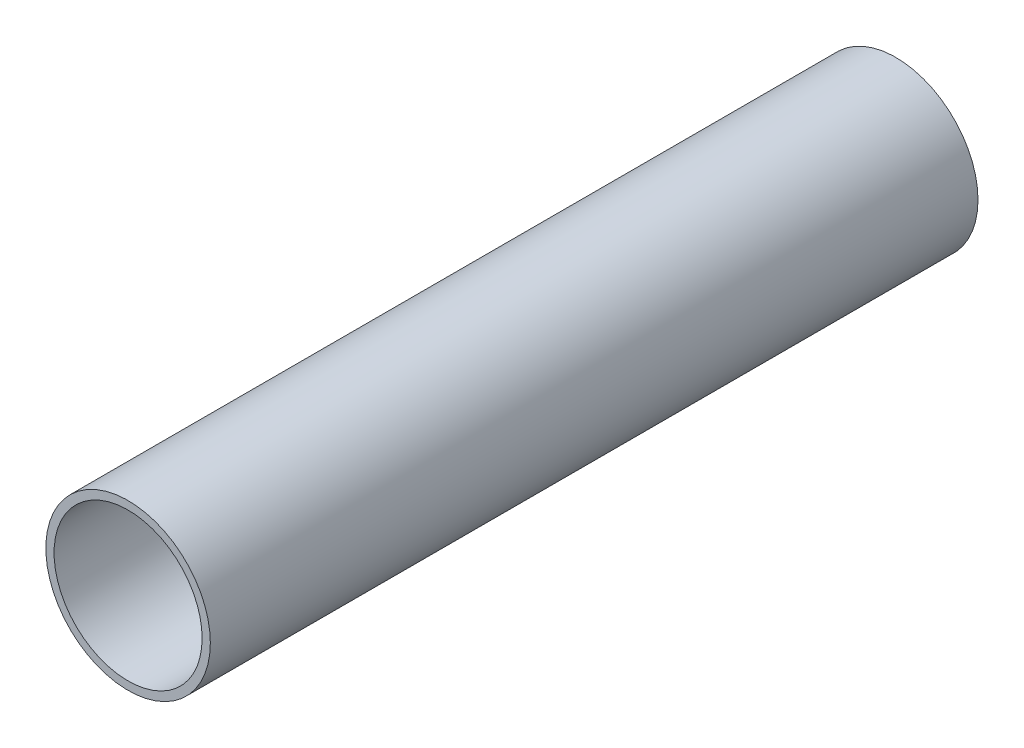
ISO-10303-21;
HEADER;
FILE_DESCRIPTION(('STEP AP214'),'2;1');
FILE_NAME('part.step','',(''),(''),'','','');
FILE_SCHEMA(('AUTOMOTIVE_DESIGN { 1 0 10303 214 1 1 1 1 }'));
ENDSEC;
DATA;
#1=APPLICATION_CONTEXT('core data for automotive mechanical design processes');
#2=APPLICATION_PROTOCOL_DEFINITION('international standard','automotive_design',2000,#1);
#3=PRODUCT_CONTEXT('',#1,'mechanical');
#4=PRODUCT('Part','Part','',(#3));
#5=PRODUCT_RELATED_PRODUCT_CATEGORY('part','',(#4));
#6=PRODUCT_DEFINITION_FORMATION('','',#4);
#7=PRODUCT_DEFINITION_CONTEXT('part definition',#1,'design');
#8=PRODUCT_DEFINITION('design','',#6,#7);
#9=PRODUCT_DEFINITION_SHAPE('','',#8);
#10=(LENGTH_UNIT() NAMED_UNIT(*) SI_UNIT(.MILLI.,.METRE.));
#11=(NAMED_UNIT(*) PLANE_ANGLE_UNIT() SI_UNIT($,.RADIAN.));
#12=(NAMED_UNIT(*) SI_UNIT($,.STERADIAN.) SOLID_ANGLE_UNIT());
#13=UNCERTAINTY_MEASURE_WITH_UNIT(LENGTH_MEASURE(1.E-05),#10,'distance_accuracy_value','');
#14=(GEOMETRIC_REPRESENTATION_CONTEXT(3) GLOBAL_UNCERTAINTY_ASSIGNED_CONTEXT((#13)) GLOBAL_UNIT_ASSIGNED_CONTEXT((#10,
#11,#12)) REPRESENTATION_CONTEXT('',''));
#15=CARTESIAN_POINT('',(0.,0.,0.));
#16=DIRECTION('',(0.,0.,1.));
#17=DIRECTION('',(1.,0.,0.));
#18=AXIS2_PLACEMENT_3D('',#15,#16,#17);
#19=CARTESIAN_POINT('',(0.,0.,140.));
#20=DIRECTION('',(0.,0.,1.));
#21=DIRECTION('',(1.,0.,0.));
#22=AXIS2_PLACEMENT_3D('',#19,#20,#21);
#23=PLANE('',#22);
#24=CARTESIAN_POINT('',(0.,0.,140.));
#25=DIRECTION('',(0.,0.,1.));
#26=DIRECTION('',(1.,0.,0.));
#27=AXIS2_PLACEMENT_3D('',#24,#25,#26);
#28=CIRCLE('',#27,15.);
#29=CARTESIAN_POINT('',(15.,0.,140.));
#30=VERTEX_POINT('',#29);
#31=EDGE_CURVE('E10',#30,#30,#28,.T.);
#32=ORIENTED_EDGE('',*,*,#31,.T.);
#33=EDGE_LOOP('',(#32));
#34=FACE_BOUND('',#33,.T.);
#35=CARTESIAN_POINT('',(0.,0.,140.));
#36=DIRECTION('',(0.,0.,1.));
#37=DIRECTION('',(1.,0.,0.));
#38=AXIS2_PLACEMENT_3D('',#35,#36,#37);
#39=CIRCLE('',#38,13.5);
#40=CARTESIAN_POINT('',(13.5,0.,140.));
#41=VERTEX_POINT('',#40);
#42=EDGE_CURVE('E39',#41,#41,#39,.T.);
#43=ORIENTED_EDGE('',*,*,#42,.F.);
#44=EDGE_LOOP('',(#43));
#45=FACE_BOUND('',#44,.T.);
#46=ADVANCED_FACE('F28',(#34,#45),#23,.T.);
#47=CARTESIAN_POINT('',(0.,0.,0.));
#48=DIRECTION('',(0.,0.,1.));
#49=DIRECTION('',(1.,0.,0.));
#50=AXIS2_PLACEMENT_3D('',#47,#48,#49);
#51=PLANE('',#50);
#52=CARTESIAN_POINT('',(0.,0.,0.));
#53=DIRECTION('',(0.,0.,1.));
#54=DIRECTION('',(1.,0.,0.));
#55=AXIS2_PLACEMENT_3D('',#52,#53,#54);
#56=CIRCLE('',#55,15.);
#57=CARTESIAN_POINT('',(15.,0.,0.));
#58=VERTEX_POINT('',#57);
#59=EDGE_CURVE('E32',#58,#58,#56,.T.);
#60=ORIENTED_EDGE('',*,*,#59,.F.);
#61=EDGE_LOOP('',(#60));
#62=FACE_BOUND('',#61,.T.);
#63=CARTESIAN_POINT('',(0.,0.,0.));
#64=DIRECTION('',(0.,0.,1.));
#65=DIRECTION('',(1.,0.,0.));
#66=AXIS2_PLACEMENT_3D('',#63,#64,#65);
#67=CIRCLE('',#66,13.5);
#68=CARTESIAN_POINT('',(13.5,0.,0.));
#69=VERTEX_POINT('',#68);
#70=EDGE_CURVE('E41',#69,#69,#67,.T.);
#71=ORIENTED_EDGE('',*,*,#70,.T.);
#72=EDGE_LOOP('',(#71));
#73=FACE_BOUND('',#72,.T.);
#74=ADVANCED_FACE('F51',(#62,#73),#51,.F.);
#75=CARTESIAN_POINT('',(0.,0.,140.));
#76=DIRECTION('',(0.,0.,-1.));
#77=DIRECTION('',(-1.,0.,0.));
#78=AXIS2_PLACEMENT_3D('',#75,#76,#77);
#79=CYLINDRICAL_SURFACE('',#78,15.);
#80=ORIENTED_EDGE('',*,*,#31,.F.);
#81=EDGE_LOOP('',(#80));
#82=FACE_BOUND('',#81,.T.);
#83=ORIENTED_EDGE('',*,*,#59,.T.);
#84=EDGE_LOOP('',(#83));
#85=FACE_BOUND('',#84,.T.);
#86=ADVANCED_FACE('F30',(#82,#85),#79,.T.);
#87=CARTESIAN_POINT('',(0.,0.,140.));
#88=DIRECTION('',(0.,0.,-1.));
#89=DIRECTION('',(-1.,0.,0.));
#90=AXIS2_PLACEMENT_3D('',#87,#88,#89);
#91=CYLINDRICAL_SURFACE('',#90,13.5);
#92=ORIENTED_EDGE('',*,*,#42,.T.);
#93=EDGE_LOOP('',(#92));
#94=FACE_BOUND('',#93,.T.);
#95=ORIENTED_EDGE('',*,*,#70,.F.);
#96=EDGE_LOOP('',(#95));
#97=FACE_BOUND('',#96,.T.);
#98=ADVANCED_FACE('F47',(#94,#97),#91,.F.);
#99=CLOSED_SHELL('',(#46,#74,#86,#98));
#100=MANIFOLD_SOLID_BREP('B2',#99);
#101=ADVANCED_BREP_SHAPE_REPRESENTATION('',(#18,#100),#14);
#102=SHAPE_DEFINITION_REPRESENTATION(#9,#101);
ENDSEC;
END-ISO-10303-21;
